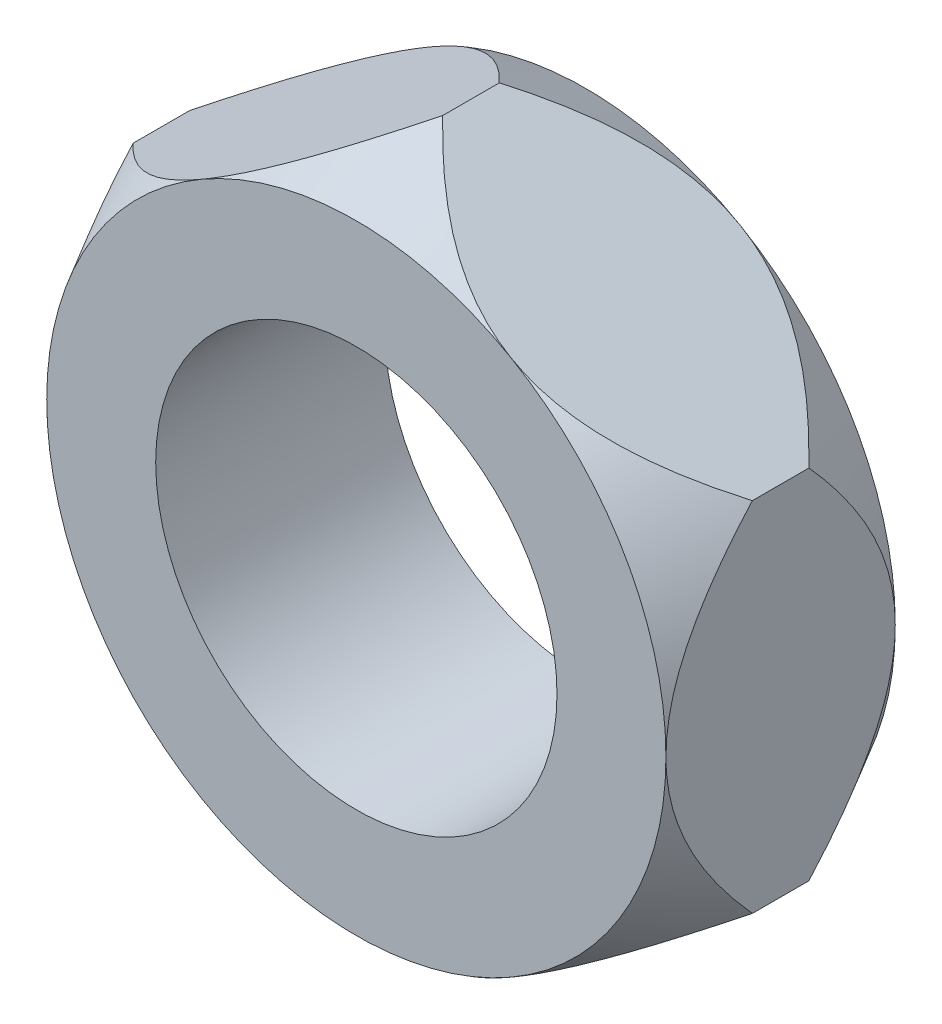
ISO-10303-21;
HEADER;
FILE_DESCRIPTION(('STEP AP214'),'2;1');
FILE_NAME('part.step','',(''),(''),'','','');
FILE_SCHEMA(('AUTOMOTIVE_DESIGN { 1 0 10303 214 1 1 1 1 }'));
ENDSEC;
DATA;
#1=APPLICATION_CONTEXT('core data for automotive mechanical design processes');
#2=APPLICATION_PROTOCOL_DEFINITION('international standard','automotive_design',2000,#1);
#3=PRODUCT_CONTEXT('',#1,'mechanical');
#4=PRODUCT('Part','Part','',(#3));
#5=PRODUCT_RELATED_PRODUCT_CATEGORY('part','',(#4));
#6=PRODUCT_DEFINITION_FORMATION('','',#4);
#7=PRODUCT_DEFINITION_CONTEXT('part definition',#1,'design');
#8=PRODUCT_DEFINITION('design','',#6,#7);
#9=PRODUCT_DEFINITION_SHAPE('','',#8);
#10=(LENGTH_UNIT() NAMED_UNIT(*) SI_UNIT(.MILLI.,.METRE.));
#11=(NAMED_UNIT(*) PLANE_ANGLE_UNIT() SI_UNIT($,.RADIAN.));
#12=(NAMED_UNIT(*) SI_UNIT($,.STERADIAN.) SOLID_ANGLE_UNIT());
#13=UNCERTAINTY_MEASURE_WITH_UNIT(LENGTH_MEASURE(1.E-05),#10,'distance_accuracy_value','');
#14=(GEOMETRIC_REPRESENTATION_CONTEXT(3) GLOBAL_UNCERTAINTY_ASSIGNED_CONTEXT((#13)) GLOBAL_UNIT_ASSIGNED_CONTEXT((#10,
#11,#12)) REPRESENTATION_CONTEXT('',''));
#15=CARTESIAN_POINT('',(0.,0.,0.));
#16=DIRECTION('',(0.,0.,1.));
#17=DIRECTION('',(1.,0.,0.));
#18=AXIS2_PLACEMENT_3D('',#15,#16,#17);
#19=CARTESIAN_POINT('',(2.7,1.55884572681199,2.));
#20=DIRECTION('',(-0.5,-0.866025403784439,0.));
#21=DIRECTION('',(0.866025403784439,-0.5,0.));
#22=AXIS2_PLACEMENT_3D('',#19,#20,#21);
#23=PLANE('',#22);
#24=DIRECTION('',(0.,0.,-1.));
#25=VECTOR('',#24,1.);
#26=CARTESIAN_POINT('',(2.7,1.55884572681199,2.));
#27=LINE('',#26,#25);
#28=CARTESIAN_POINT('',(2.7,1.55884572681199,1.2464646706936));
#29=VERTEX_POINT('',#28);
#30=CARTESIAN_POINT('',(2.7,1.55884572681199,0.753535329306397));
#31=VERTEX_POINT('',#30);
#32=EDGE_CURVE('E147',#29,#31,#27,.T.);
#33=ORIENTED_EDGE('',*,*,#32,.T.);
#34=CARTESIAN_POINT('',(2.7002,1.55873025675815,0.753743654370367));
#35=CARTESIAN_POINT('',(2.64419141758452,1.59106682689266,0.695475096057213));
#36=CARTESIAN_POINT('',(2.58702488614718,1.62407193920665,0.638578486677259));
#37=CARTESIAN_POINT('',(2.46958468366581,1.69187607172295,0.528431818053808));
#38=CARTESIAN_POINT('',(2.40929511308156,1.72668427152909,0.475204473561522));
#39=CARTESIAN_POINT('',(2.28374274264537,1.79917196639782,0.372600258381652));
#40=CARTESIAN_POINT('',(2.21838872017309,1.83690412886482,0.323369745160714));
#41=CARTESIAN_POINT('',(2.08394160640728,1.91452720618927,0.232596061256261));
#42=CARTESIAN_POINT('',(2.01485800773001,1.95441264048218,0.191034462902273));
#43=CARTESIAN_POINT('',(1.86986599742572,2.03812381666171,0.116709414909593));
#44=CARTESIAN_POINT('',(1.79379644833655,2.08204259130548,0.0843526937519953));
#45=CARTESIAN_POINT('',(1.63864870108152,2.17161718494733,0.0344081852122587));
#46=CARTESIAN_POINT('',(1.55960038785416,2.21725574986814,0.0167011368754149));
#47=CARTESIAN_POINT('',(1.39916202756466,2.30988488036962,-0.00179955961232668));
#48=CARTESIAN_POINT('',(1.31775648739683,2.35688439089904,-0.00242274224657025));
#49=CARTESIAN_POINT('',(1.15615297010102,2.45018622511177,0.0138009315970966));
#50=CARTESIAN_POINT('',(1.07595804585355,2.49648678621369,0.0306862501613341));
#51=CARTESIAN_POINT('',(0.89993793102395,2.59811204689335,0.0853197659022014));
#52=CARTESIAN_POINT('',(0.80509571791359,2.65286922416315,0.127165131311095));
#53=CARTESIAN_POINT('',(0.621874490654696,2.75865204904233,0.227329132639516));
#54=CARTESIAN_POINT('',(0.533534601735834,2.80965510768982,0.285738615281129));
#55=CARTESIAN_POINT('',(0.368100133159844,2.90516874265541,0.409739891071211));
#56=CARTESIAN_POINT('',(0.290650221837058,2.94988446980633,0.474714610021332));
#57=CARTESIAN_POINT('',(0.178509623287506,3.014628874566,0.576692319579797));
#58=CARTESIAN_POINT('',(0.142054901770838,3.03567601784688,0.611168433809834));
#59=CARTESIAN_POINT('',(0.0701839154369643,3.07717075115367,0.681486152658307));
#60=CARTESIAN_POINT('',(0.034767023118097,3.09761870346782,0.717326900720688));
#61=CARTESIAN_POINT('',(-0.000200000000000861,3.11780692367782,0.753743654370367));
#62=B_SPLINE_CURVE_WITH_KNOTS('',3,(#34,#35,#36,#37,#38,#39,#40,#41,#42,#43,#44,#45,#46,#47,#48,
#49,#50,#51,#52,#53,#54,#55,#56,#57,#58,#59,#60,#61),.UNSPECIFIED.,.F.,.F.,(4,2,2,2,2,2,2,2,2,2,
2,2,2,4),(0.,0.261243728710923,0.523981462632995,0.793952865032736,1.06326685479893,
1.34309271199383,1.62061748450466,1.90091044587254,2.18182045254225,2.53153788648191,
2.8832117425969,3.2143875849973,3.37759740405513,3.54070641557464),.UNSPECIFIED.);
#63=CARTESIAN_POINT('',(1.35,2.33826859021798,0.));
#64=VERTEX_POINT('',#63);
#65=EDGE_CURVE('E53',#31,#64,#62,.T.);
#66=ORIENTED_EDGE('',*,*,#65,.T.);
#67=CARTESIAN_POINT('',(0.,3.11769145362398,0.753535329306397));
#68=VERTEX_POINT('',#67);
#69=EDGE_CURVE('E121',#64,#68,#62,.T.);
#70=ORIENTED_EDGE('',*,*,#69,.T.);
#71=DIRECTION('',(0.,0.,-1.));
#72=VECTOR('',#71,1.);
#73=CARTESIAN_POINT('',(0.,3.11769145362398,2.));
#74=LINE('',#73,#72);
#75=CARTESIAN_POINT('',(0.,3.11769145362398,1.2464646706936));
#76=VERTEX_POINT('',#75);
#77=EDGE_CURVE('E251',#76,#68,#74,.T.);
#78=ORIENTED_EDGE('',*,*,#77,.F.);
#79=CARTESIAN_POINT('',(2.7002,1.55873025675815,1.24625634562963));
#80=CARTESIAN_POINT('',(2.64419141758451,1.59106682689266,1.30452490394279));
#81=CARTESIAN_POINT('',(2.58702488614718,1.62407193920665,1.36142151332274));
#82=CARTESIAN_POINT('',(2.46958468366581,1.69187607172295,1.47156818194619));
#83=CARTESIAN_POINT('',(2.40929511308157,1.72668427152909,1.52479552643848));
#84=CARTESIAN_POINT('',(2.28374274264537,1.79917196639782,1.62739974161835));
#85=CARTESIAN_POINT('',(2.21838872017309,1.83690412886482,1.67663025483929));
#86=CARTESIAN_POINT('',(2.08394160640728,1.91452720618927,1.76740393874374));
#87=CARTESIAN_POINT('',(2.01485800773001,1.95441264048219,1.80896553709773));
#88=CARTESIAN_POINT('',(1.86986599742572,2.03812381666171,1.88329058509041));
#89=CARTESIAN_POINT('',(1.79379644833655,2.08204259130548,1.91564730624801));
#90=CARTESIAN_POINT('',(1.63864870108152,2.17161718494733,1.96559181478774));
#91=CARTESIAN_POINT('',(1.55960038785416,2.21725574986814,1.98329886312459));
#92=CARTESIAN_POINT('',(1.39916202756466,2.30988488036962,2.00179955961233));
#93=CARTESIAN_POINT('',(1.31775648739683,2.35688439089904,2.00242274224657));
#94=CARTESIAN_POINT('',(1.15615297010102,2.45018622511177,1.9861990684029));
#95=CARTESIAN_POINT('',(1.07595804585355,2.49648678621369,1.96931374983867));
#96=CARTESIAN_POINT('',(0.89993793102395,2.59811204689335,1.9146802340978));
#97=CARTESIAN_POINT('',(0.80509571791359,2.65286922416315,1.8728348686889));
#98=CARTESIAN_POINT('',(0.621874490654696,2.75865204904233,1.77267086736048));
#99=CARTESIAN_POINT('',(0.533534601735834,2.80965510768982,1.71426138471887));
#100=CARTESIAN_POINT('',(0.368100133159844,2.90516874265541,1.59026010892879));
#101=CARTESIAN_POINT('',(0.290650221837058,2.94988446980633,1.52528538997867));
#102=CARTESIAN_POINT('',(0.178509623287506,3.014628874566,1.4233076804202));
#103=CARTESIAN_POINT('',(0.142054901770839,3.03567601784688,1.38883156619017));
#104=CARTESIAN_POINT('',(0.0701839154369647,3.07717075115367,1.31851384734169));
#105=CARTESIAN_POINT('',(0.0347670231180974,3.09761870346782,1.28267309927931));
#106=CARTESIAN_POINT('',(-0.000200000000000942,3.11780692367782,1.24625634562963));
#107=B_SPLINE_CURVE_WITH_KNOTS('',3,(#79,#80,#81,#82,#83,#84,#85,#86,#87,#88,#89,#90,#91,#92,
#93,#94,#95,#96,#97,#98,#99,#100,#101,#102,#103,#104,#105,#106),.UNSPECIFIED.,.F.,.F.,(4,2,2,2,
2,2,2,2,2,2,2,2,2,4),(0.,0.261243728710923,0.523981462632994,0.793952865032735,1.06326685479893,
1.34309271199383,1.62061748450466,1.90091044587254,2.18182045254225,2.53153788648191,
2.8832117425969,3.2143875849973,3.37759740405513,3.54070641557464),.UNSPECIFIED.);
#108=CARTESIAN_POINT('',(1.35,2.33826859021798,2.));
#109=VERTEX_POINT('',#108);
#110=EDGE_CURVE('E232',#109,#76,#107,.T.);
#111=ORIENTED_EDGE('',*,*,#110,.F.);
#112=EDGE_CURVE('E237',#29,#109,#107,.T.);
#113=ORIENTED_EDGE('',*,*,#112,.F.);
#114=EDGE_LOOP('',(#33,#66,#70,#78,#111,#113));
#115=FACE_BOUND('',#114,.T.);
#116=ADVANCED_FACE('F32',(#115),#23,.F.);
#117=CARTESIAN_POINT('',(0.,3.11769145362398,2.));
#118=DIRECTION('',(0.5,-0.866025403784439,0.));
#119=DIRECTION('',(0.866025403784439,0.5,0.));
#120=AXIS2_PLACEMENT_3D('',#117,#118,#119);
#121=PLANE('',#120);
#122=ORIENTED_EDGE('',*,*,#77,.T.);
#123=CARTESIAN_POINT('',(0.000199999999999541,3.11780692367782,0.753743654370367));
#124=CARTESIAN_POINT('',(-0.0558085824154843,3.08547035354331,0.695475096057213));
#125=CARTESIAN_POINT('',(-0.112975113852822,3.05246524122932,0.638578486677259));
#126=CARTESIAN_POINT('',(-0.230415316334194,2.98466110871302,0.528431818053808));
#127=CARTESIAN_POINT('',(-0.290704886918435,2.94985290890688,0.475204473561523));
#128=CARTESIAN_POINT('',(-0.416257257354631,2.87736521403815,0.372600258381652));
#129=CARTESIAN_POINT('',(-0.481611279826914,2.83963305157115,0.323369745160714));
#130=CARTESIAN_POINT('',(-0.616058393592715,2.7620099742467,0.232596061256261));
#131=CARTESIAN_POINT('',(-0.685141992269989,2.72212453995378,0.191034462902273));
#132=CARTESIAN_POINT('',(-0.830134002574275,2.63841336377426,0.116709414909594));
#133=CARTESIAN_POINT('',(-0.906203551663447,2.59449458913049,0.0843526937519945));
#134=CARTESIAN_POINT('',(-1.06135129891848,2.50491999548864,0.0344081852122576));
#135=CARTESIAN_POINT('',(-1.14039961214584,2.45928143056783,0.0167011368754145));
#136=CARTESIAN_POINT('',(-1.30083797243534,2.36665230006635,-0.0017995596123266));
#137=CARTESIAN_POINT('',(-1.38224351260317,2.31965278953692,-0.00242274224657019));
#138=CARTESIAN_POINT('',(-1.54384702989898,2.2263509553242,0.0138009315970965));
#139=CARTESIAN_POINT('',(-1.62404195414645,2.18005039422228,0.0306862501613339));
#140=CARTESIAN_POINT('',(-1.80006206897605,2.07842513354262,0.0853197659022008));
#141=CARTESIAN_POINT('',(-1.89490428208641,2.02366795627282,0.127165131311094));
#142=CARTESIAN_POINT('',(-2.0781255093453,1.91788513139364,0.227329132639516));
#143=CARTESIAN_POINT('',(-2.16646539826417,1.86688207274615,0.285738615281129));
#144=CARTESIAN_POINT('',(-2.33189986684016,1.77136843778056,0.409739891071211));
#145=CARTESIAN_POINT('',(-2.40934977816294,1.72665271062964,0.474714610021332));
#146=CARTESIAN_POINT('',(-2.52149037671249,1.66190830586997,0.576692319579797));
#147=CARTESIAN_POINT('',(-2.55794509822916,1.64086116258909,0.611168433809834));
#148=CARTESIAN_POINT('',(-2.62981608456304,1.5993664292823,0.681486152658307));
#149=CARTESIAN_POINT('',(-2.6652329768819,1.57891847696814,0.717326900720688));
#150=CARTESIAN_POINT('',(-2.7002,1.55873025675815,0.753743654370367));
#151=B_SPLINE_CURVE_WITH_KNOTS('',3,(#123,#124,#125,#126,#127,#128,#129,#130,#131,#132,#133,
#134,#135,#136,#137,#138,#139,#140,#141,#142,#143,#144,#145,#146,#147,#148,#149,#150),
.UNSPECIFIED.,.F.,.F.,(4,2,2,2,2,2,2,2,2,2,2,2,2,4),(0.,0.261243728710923,0.523981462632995,
0.793952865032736,1.06326685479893,1.34309271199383,1.62061748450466,1.90091044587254,
2.18182045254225,2.53153788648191,2.8832117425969,3.2143875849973,3.37759740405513,
3.54070641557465),.UNSPECIFIED.);
#152=CARTESIAN_POINT('',(-1.35,2.33826859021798,0.));
#153=VERTEX_POINT('',#152);
#154=EDGE_CURVE('E126',#68,#153,#151,.T.);
#155=ORIENTED_EDGE('',*,*,#154,.T.);
#156=CARTESIAN_POINT('',(-2.7,1.55884572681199,0.753535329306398));
#157=VERTEX_POINT('',#156);
#158=EDGE_CURVE('E157',#153,#157,#151,.T.);
#159=ORIENTED_EDGE('',*,*,#158,.T.);
#160=DIRECTION('',(0.,0.,-1.));
#161=VECTOR('',#160,1.);
#162=CARTESIAN_POINT('',(-2.7,1.55884572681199,2.));
#163=LINE('',#162,#161);
#164=CARTESIAN_POINT('',(-2.7,1.55884572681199,1.2464646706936));
#165=VERTEX_POINT('',#164);
#166=EDGE_CURVE('E248',#165,#157,#163,.T.);
#167=ORIENTED_EDGE('',*,*,#166,.F.);
#168=CARTESIAN_POINT('',(0.000199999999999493,3.11780692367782,1.24625634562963));
#169=CARTESIAN_POINT('',(-0.0558085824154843,3.08547035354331,1.30452490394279));
#170=CARTESIAN_POINT('',(-0.112975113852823,3.05246524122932,1.36142151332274));
#171=CARTESIAN_POINT('',(-0.230415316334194,2.98466110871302,1.47156818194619));
#172=CARTESIAN_POINT('',(-0.290704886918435,2.94985290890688,1.52479552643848));
#173=CARTESIAN_POINT('',(-0.416257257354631,2.87736521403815,1.62739974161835));
#174=CARTESIAN_POINT('',(-0.481611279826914,2.83963305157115,1.67663025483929));
#175=CARTESIAN_POINT('',(-0.616058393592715,2.7620099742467,1.76740393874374));
#176=CARTESIAN_POINT('',(-0.685141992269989,2.72212453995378,1.80896553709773));
#177=CARTESIAN_POINT('',(-0.830134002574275,2.63841336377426,1.88329058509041));
#178=CARTESIAN_POINT('',(-0.906203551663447,2.59449458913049,1.91564730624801));
#179=CARTESIAN_POINT('',(-1.06135129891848,2.50491999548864,1.96559181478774));
#180=CARTESIAN_POINT('',(-1.14039961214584,2.45928143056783,1.98329886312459));
#181=CARTESIAN_POINT('',(-1.30083797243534,2.36665230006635,2.00179955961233));
#182=CARTESIAN_POINT('',(-1.38224351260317,2.31965278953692,2.00242274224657));
#183=CARTESIAN_POINT('',(-1.54384702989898,2.2263509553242,1.9861990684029));
#184=CARTESIAN_POINT('',(-1.62404195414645,2.18005039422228,1.96931374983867));
#185=CARTESIAN_POINT('',(-1.80006206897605,2.07842513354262,1.9146802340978));
#186=CARTESIAN_POINT('',(-1.89490428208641,2.02366795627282,1.87283486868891));
#187=CARTESIAN_POINT('',(-2.0781255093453,1.91788513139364,1.77267086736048));
#188=CARTESIAN_POINT('',(-2.16646539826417,1.86688207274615,1.71426138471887));
#189=CARTESIAN_POINT('',(-2.33189986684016,1.77136843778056,1.59026010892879));
#190=CARTESIAN_POINT('',(-2.40934977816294,1.72665271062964,1.52528538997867));
#191=CARTESIAN_POINT('',(-2.52149037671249,1.66190830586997,1.4233076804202));
#192=CARTESIAN_POINT('',(-2.55794509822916,1.64086116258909,1.38883156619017));
#193=CARTESIAN_POINT('',(-2.62981608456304,1.5993664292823,1.31851384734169));
#194=CARTESIAN_POINT('',(-2.6652329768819,1.57891847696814,1.28267309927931));
#195=CARTESIAN_POINT('',(-2.7002,1.55873025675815,1.24625634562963));
#196=B_SPLINE_CURVE_WITH_KNOTS('',3,(#168,#169,#170,#171,#172,#173,#174,#175,#176,#177,#178,
#179,#180,#181,#182,#183,#184,#185,#186,#187,#188,#189,#190,#191,#192,#193,#194,#195),
.UNSPECIFIED.,.F.,.F.,(4,2,2,2,2,2,2,2,2,2,2,2,2,4),(0.,0.261243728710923,0.523981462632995,
0.793952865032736,1.06326685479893,1.34309271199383,1.62061748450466,1.90091044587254,
2.18182045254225,2.53153788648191,2.8832117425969,3.2143875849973,3.37759740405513,
3.54070641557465),.UNSPECIFIED.);
#197=CARTESIAN_POINT('',(-1.35,2.33826859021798,2.));
#198=VERTEX_POINT('',#197);
#199=EDGE_CURVE('E226',#198,#165,#196,.T.);
#200=ORIENTED_EDGE('',*,*,#199,.F.);
#201=EDGE_CURVE('E231',#76,#198,#196,.T.);
#202=ORIENTED_EDGE('',*,*,#201,.F.);
#203=EDGE_LOOP('',(#122,#155,#159,#167,#200,#202));
#204=FACE_BOUND('',#203,.T.);
#205=ADVANCED_FACE('F207',(#204),#121,.F.);
#206=CARTESIAN_POINT('',(-2.7,1.55884572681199,2.));
#207=DIRECTION('',(1.,0.,0.));
#208=DIRECTION('',(0.,1.,0.));
#209=AXIS2_PLACEMENT_3D('',#206,#207,#208);
#210=PLANE('',#209);
#211=ORIENTED_EDGE('',*,*,#166,.T.);
#212=CARTESIAN_POINT('',(-2.7,-2.87817931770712,2.24852928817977));
#213=CARTESIAN_POINT('',(-2.7,-2.8186589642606,2.17023395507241));
#214=CARTESIAN_POINT('',(-2.7,-2.75860419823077,2.0923388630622));
#215=CARTESIAN_POINT('',(-2.7,-2.63720662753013,1.93752788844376));
#216=CARTESIAN_POINT('',(-2.7,-2.57586349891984,1.86061226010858));
#217=CARTESIAN_POINT('',(-2.7,-2.45110039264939,1.7072418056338));
#218=CARTESIAN_POINT('',(-2.7,-2.38766607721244,1.63079860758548));
#219=CARTESIAN_POINT('',(-2.7,-2.25902577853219,1.47942646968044));
#220=CARTESIAN_POINT('',(-2.7,-2.1938199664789,1.40449738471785));
#221=CARTESIAN_POINT('',(-2.7,-2.05645651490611,1.25112014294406));
#222=CARTESIAN_POINT('',(-2.7,-1.98413893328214,1.17281456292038));
#223=CARTESIAN_POINT('',(-2.7,-1.83655748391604,1.0190347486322));
#224=CARTESIAN_POINT('',(-2.7,-1.76129405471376,0.943560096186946));
#225=CARTESIAN_POINT('',(-2.7,-1.60744597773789,0.796663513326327));
#226=CARTESIAN_POINT('',(-2.7,-1.52887539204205,0.725226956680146));
#227=CARTESIAN_POINT('',(-2.7,-1.36737041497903,0.587509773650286));
#228=CARTESIAN_POINT('',(-2.7,-1.28443921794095,0.521225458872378));
#229=CARTESIAN_POINT('',(-2.7,-1.14666852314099,0.42037343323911));
#230=CARTESIAN_POINT('',(-2.7,-1.09350675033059,0.383528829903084));
#231=CARTESIAN_POINT('',(-2.7,-0.98499557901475,0.313203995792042));
#232=CARTESIAN_POINT('',(-2.7,-0.929645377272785,0.279725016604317));
#233=CARTESIAN_POINT('',(-2.7,-0.761123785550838,0.186194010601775));
#234=CARTESIAN_POINT('',(-2.7,-0.644345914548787,0.132176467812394));
#235=CARTESIAN_POINT('',(-2.7,-0.438990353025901,0.0617142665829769));
#236=CARTESIAN_POINT('',(-2.7,-0.352652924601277,0.0388372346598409));
#237=CARTESIAN_POINT('',(-2.7,-0.177313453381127,0.00796631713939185));
#238=CARTESIAN_POINT('',(-2.7,-0.0883138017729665,-4.0539679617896E-05));
#239=CARTESIAN_POINT('',(-2.7,0.0898668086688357,4.09368854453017E-05));
#240=CARTESIAN_POINT('',(-2.7,0.179047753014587,0.00816333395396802));
#241=CARTESIAN_POINT('',(-2.7,0.354722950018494,0.0393129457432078));
#242=CARTESIAN_POINT('',(-2.7,0.441214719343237,0.0623535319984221));
#243=CARTESIAN_POINT('',(-2.7,0.648765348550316,0.133878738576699));
#244=CARTESIAN_POINT('',(-2.7,0.767436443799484,0.18919099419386));
#245=CARTESIAN_POINT('',(-2.7,0.93857097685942,0.284963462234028));
#246=CARTESIAN_POINT('',(-2.7,0.994762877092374,0.319248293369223));
#247=CARTESIAN_POINT('',(-2.7,1.10489430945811,0.391254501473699));
#248=CARTESIAN_POINT('',(-2.7,1.15883465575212,0.428974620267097));
#249=CARTESIAN_POINT('',(-2.7,1.29456380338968,0.529225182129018));
#250=CARTESIAN_POINT('',(-2.7,1.37487791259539,0.593737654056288));
#251=CARTESIAN_POINT('',(-2.7,1.53141731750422,0.727579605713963));
#252=CARTESIAN_POINT('',(-2.7,1.60763994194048,0.796912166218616));
#253=CARTESIAN_POINT('',(-2.7,1.75696307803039,0.939362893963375));
#254=CARTESIAN_POINT('',(-2.7,1.83005137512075,1.01249377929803));
#255=CARTESIAN_POINT('',(-2.7,1.97343386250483,1.16144862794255));
#256=CARTESIAN_POINT('',(-2.7,2.04372766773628,1.23727295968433));
#257=CARTESIAN_POINT('',(-2.7,2.17745100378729,1.38594673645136));
#258=CARTESIAN_POINT('',(-2.7,2.24102802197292,1.45866412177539));
#259=CARTESIAN_POINT('',(-2.7,2.36647734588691,1.60556225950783));
#260=CARTESIAN_POINT('',(-2.7,2.42834950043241,1.67974314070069));
#261=CARTESIAN_POINT('',(-2.7,2.55009776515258,1.82862770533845));
#262=CARTESIAN_POINT('',(-2.7,2.609986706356,1.90332092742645));
#263=CARTESIAN_POINT('',(-2.7,2.7285155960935,2.05366355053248));
#264=CARTESIAN_POINT('',(-2.7,2.78715584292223,2.12931271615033));
#265=CARTESIAN_POINT('',(-2.7,2.84527586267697,2.20535374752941));
#266=B_SPLINE_CURVE_WITH_KNOTS('',3,(#212,#213,#214,#215,#216,#217,#218,#219,#220,#221,#222,
#223,#224,#225,#226,#227,#228,#229,#230,#231,#232,#233,#234,#235,#236,#237,#238,#239,#240,#241,
#242,#243,#244,#245,#246,#247,#248,#249,#250,#251,#252,#253,#254,#255,#256,#257,#258,#259,#260,
#261,#262,#263,#264,#265),.UNSPECIFIED.,.F.,.F.,(4,2,2,2,2,2,2,2,2,2,2,2,2,2,2,2,2,2,2,2,2,2,2,
2,2,2,4),(0.,0.295056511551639,0.590188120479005,0.888170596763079,1.1861243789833,
1.50583568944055,1.82549958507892,2.1439196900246,2.46210970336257,2.65603493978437,
2.8500320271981,3.23376233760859,3.50065084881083,3.76730644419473,4.03452579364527,
4.30198499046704,4.69239792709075,4.88980852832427,5.08714711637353,5.39592214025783,
5.7048963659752,6.01498181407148,6.32510984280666,6.61485293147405,6.90462163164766,
7.19182200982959,7.47895299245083),.UNSPECIFIED.);
#267=CARTESIAN_POINT('',(-2.7,0.,0.));
#268=VERTEX_POINT('',#267);
#269=EDGE_CURVE('E201',#157,#268,#266,.F.);
#270=ORIENTED_EDGE('',*,*,#269,.T.);
#271=CARTESIAN_POINT('',(-2.7,-1.55884572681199,0.753535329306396));
#272=VERTEX_POINT('',#271);
#273=EDGE_CURVE('E195',#268,#272,#266,.F.);
#274=ORIENTED_EDGE('',*,*,#273,.T.);
#275=DIRECTION('',(0.,0.,-1.));
#276=VECTOR('',#275,1.);
#277=CARTESIAN_POINT('',(-2.7,-1.55884572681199,2.));
#278=LINE('',#277,#276);
#279=CARTESIAN_POINT('',(-2.7,-1.55884572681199,1.2464646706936));
#280=VERTEX_POINT('',#279);
#281=EDGE_CURVE('E245',#280,#272,#278,.T.);
#282=ORIENTED_EDGE('',*,*,#281,.F.);
#283=CARTESIAN_POINT('',(-2.7,-2.87817931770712,-0.248529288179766));
#284=CARTESIAN_POINT('',(-2.7,-2.8186589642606,-0.170233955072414));
#285=CARTESIAN_POINT('',(-2.7,-2.75860419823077,-0.0923388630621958));
#286=CARTESIAN_POINT('',(-2.7,-2.63720662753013,0.062472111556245));
#287=CARTESIAN_POINT('',(-2.7,-2.57586349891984,0.139387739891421));
#288=CARTESIAN_POINT('',(-2.7,-2.45110039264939,0.292758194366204));
#289=CARTESIAN_POINT('',(-2.7,-2.38766607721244,0.369201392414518));
#290=CARTESIAN_POINT('',(-2.7,-2.25902577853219,0.520573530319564));
#291=CARTESIAN_POINT('',(-2.7,-2.1938199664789,0.595502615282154));
#292=CARTESIAN_POINT('',(-2.7,-2.05645651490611,0.748879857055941));
#293=CARTESIAN_POINT('',(-2.7,-1.98413893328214,0.827185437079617));
#294=CARTESIAN_POINT('',(-2.7,-1.83655748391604,0.980965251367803));
#295=CARTESIAN_POINT('',(-2.7,-1.76129405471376,1.05643990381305));
#296=CARTESIAN_POINT('',(-2.7,-1.60744597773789,1.20333648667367));
#297=CARTESIAN_POINT('',(-2.7,-1.52887539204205,1.27477304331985));
#298=CARTESIAN_POINT('',(-2.7,-1.36737041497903,1.41249022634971));
#299=CARTESIAN_POINT('',(-2.7,-1.28443921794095,1.47877454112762));
#300=CARTESIAN_POINT('',(-2.7,-1.14666852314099,1.57962656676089));
#301=CARTESIAN_POINT('',(-2.7,-1.09350675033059,1.61647117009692));
#302=CARTESIAN_POINT('',(-2.7,-0.98499557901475,1.68679600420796));
#303=CARTESIAN_POINT('',(-2.7,-0.929645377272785,1.72027498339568));
#304=CARTESIAN_POINT('',(-2.7,-0.761123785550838,1.81380598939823));
#305=CARTESIAN_POINT('',(-2.7,-0.644345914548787,1.86782353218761));
#306=CARTESIAN_POINT('',(-2.7,-0.438990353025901,1.93828573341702));
#307=CARTESIAN_POINT('',(-2.7,-0.352652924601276,1.96116276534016));
#308=CARTESIAN_POINT('',(-2.7,-0.177313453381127,1.99203368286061));
#309=CARTESIAN_POINT('',(-2.7,-0.0883138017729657,2.00004053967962));
#310=CARTESIAN_POINT('',(-2.7,0.0898668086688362,1.99995906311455));
#311=CARTESIAN_POINT('',(-2.7,0.179047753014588,1.99183666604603));
#312=CARTESIAN_POINT('',(-2.7,0.354722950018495,1.96068705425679));
#313=CARTESIAN_POINT('',(-2.7,0.441214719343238,1.93764646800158));
#314=CARTESIAN_POINT('',(-2.7,0.648765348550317,1.8661212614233));
#315=CARTESIAN_POINT('',(-2.7,0.767436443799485,1.81080900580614));
#316=CARTESIAN_POINT('',(-2.7,0.938570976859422,1.71503653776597));
#317=CARTESIAN_POINT('',(-2.7,0.994762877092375,1.68075170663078));
#318=CARTESIAN_POINT('',(-2.7,1.10489430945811,1.6087454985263));
#319=CARTESIAN_POINT('',(-2.7,1.15883465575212,1.5710253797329));
#320=CARTESIAN_POINT('',(-2.7,1.29456380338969,1.47077481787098));
#321=CARTESIAN_POINT('',(-2.7,1.37487791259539,1.40626234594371));
#322=CARTESIAN_POINT('',(-2.7,1.53141731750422,1.27242039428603));
#323=CARTESIAN_POINT('',(-2.7,1.60763994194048,1.20308783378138));
#324=CARTESIAN_POINT('',(-2.7,1.75696307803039,1.06063710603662));
#325=CARTESIAN_POINT('',(-2.7,1.83005137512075,0.987506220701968));
#326=CARTESIAN_POINT('',(-2.7,1.97343386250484,0.838551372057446));
#327=CARTESIAN_POINT('',(-2.7,2.04372766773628,0.762727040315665));
#328=CARTESIAN_POINT('',(-2.7,2.17745100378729,0.614053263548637));
#329=CARTESIAN_POINT('',(-2.7,2.24102802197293,0.5413358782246));
#330=CARTESIAN_POINT('',(-2.7,2.36647734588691,0.394437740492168));
#331=CARTESIAN_POINT('',(-2.7,2.42834950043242,0.320256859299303));
#332=CARTESIAN_POINT('',(-2.7,2.55009776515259,0.171372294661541));
#333=CARTESIAN_POINT('',(-2.7,2.609986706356,0.0966790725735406));
#334=CARTESIAN_POINT('',(-2.7,2.7285155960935,-0.0536635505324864));
#335=CARTESIAN_POINT('',(-2.7,2.78715584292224,-0.129312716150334));
#336=CARTESIAN_POINT('',(-2.7,2.84527586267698,-0.20535374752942));
#337=B_SPLINE_CURVE_WITH_KNOTS('',3,(#283,#284,#285,#286,#287,#288,#289,#290,#291,#292,#293,
#294,#295,#296,#297,#298,#299,#300,#301,#302,#303,#304,#305,#306,#307,#308,#309,#310,#311,#312,
#313,#314,#315,#316,#317,#318,#319,#320,#321,#322,#323,#324,#325,#326,#327,#328,#329,#330,#331,
#332,#333,#334,#335,#336),.UNSPECIFIED.,.F.,.F.,(4,2,2,2,2,2,2,2,2,2,2,2,2,2,2,2,2,2,2,2,2,2,2,
2,2,2,4),(0.,0.295056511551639,0.590188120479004,0.888170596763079,1.1861243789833,
1.50583568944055,1.82549958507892,2.1439196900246,2.46210970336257,2.65603493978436,
2.8500320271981,3.23376233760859,3.50065084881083,3.76730644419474,4.03452579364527,
4.30198499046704,4.69239792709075,4.88980852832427,5.08714711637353,5.39592214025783,
5.7048963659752,6.01498181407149,6.32510984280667,6.61485293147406,6.90462163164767,
7.1918220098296,7.47895299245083),.UNSPECIFIED.);
#338=CARTESIAN_POINT('',(-2.7,0.,2.));
#339=VERTEX_POINT('',#338);
#340=EDGE_CURVE('E213',#339,#280,#337,.F.);
#341=ORIENTED_EDGE('',*,*,#340,.F.);
#342=EDGE_CURVE('E219',#165,#339,#337,.F.);
#343=ORIENTED_EDGE('',*,*,#342,.F.);
#344=EDGE_LOOP('',(#211,#270,#274,#282,#341,#343));
#345=FACE_BOUND('',#344,.T.);
#346=ADVANCED_FACE('F203',(#345),#210,.F.);
#347=CARTESIAN_POINT('',(-2.7,-1.55884572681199,2.));
#348=DIRECTION('',(0.5,0.866025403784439,0.));
#349=DIRECTION('',(-0.866025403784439,0.5,0.));
#350=AXIS2_PLACEMENT_3D('',#347,#348,#349);
#351=PLANE('',#350);
#352=ORIENTED_EDGE('',*,*,#281,.T.);
#353=CARTESIAN_POINT('',(-2.7002,-1.55873025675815,0.753743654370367));
#354=CARTESIAN_POINT('',(-2.64419141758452,-1.59106682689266,0.695475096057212));
#355=CARTESIAN_POINT('',(-2.58702488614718,-1.62407193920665,0.638578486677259));
#356=CARTESIAN_POINT('',(-2.46958468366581,-1.69187607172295,0.528431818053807));
#357=CARTESIAN_POINT('',(-2.40929511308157,-1.72668427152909,0.475204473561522));
#358=CARTESIAN_POINT('',(-2.28374274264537,-1.79917196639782,0.372600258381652));
#359=CARTESIAN_POINT('',(-2.21838872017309,-1.83690412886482,0.323369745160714));
#360=CARTESIAN_POINT('',(-2.08394160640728,-1.91452720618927,0.23259606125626));
#361=CARTESIAN_POINT('',(-2.01485800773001,-1.95441264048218,0.191034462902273));
#362=CARTESIAN_POINT('',(-1.86986599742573,-2.03812381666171,0.116709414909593));
#363=CARTESIAN_POINT('',(-1.79379644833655,-2.08204259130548,0.0843526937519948));
#364=CARTESIAN_POINT('',(-1.63864870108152,-2.17161718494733,0.0344081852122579));
#365=CARTESIAN_POINT('',(-1.55960038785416,-2.21725574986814,0.0167011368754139));
#366=CARTESIAN_POINT('',(-1.39916202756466,-2.30988488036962,-0.00179955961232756));
#367=CARTESIAN_POINT('',(-1.31775648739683,-2.35688439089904,-0.00242274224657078));
#368=CARTESIAN_POINT('',(-1.15615297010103,-2.45018622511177,0.0138009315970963));
#369=CARTESIAN_POINT('',(-1.07595804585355,-2.49648678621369,0.0306862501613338));
#370=CARTESIAN_POINT('',(-0.899937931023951,-2.59811204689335,0.0853197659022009));
#371=CARTESIAN_POINT('',(-0.805095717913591,-2.65286922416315,0.127165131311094));
#372=CARTESIAN_POINT('',(-0.621874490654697,-2.75865204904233,0.227329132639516));
#373=CARTESIAN_POINT('',(-0.533534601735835,-2.80965510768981,0.285738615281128));
#374=CARTESIAN_POINT('',(-0.368100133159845,-2.9051687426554,0.40973989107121));
#375=CARTESIAN_POINT('',(-0.290650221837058,-2.94988446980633,0.474714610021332));
#376=CARTESIAN_POINT('',(-0.178509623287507,-3.014628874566,0.576692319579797));
#377=CARTESIAN_POINT('',(-0.142054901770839,-3.03567601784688,0.611168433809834));
#378=CARTESIAN_POINT('',(-0.0701839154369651,-3.07717075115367,0.681486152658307));
#379=CARTESIAN_POINT('',(-0.0347670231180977,-3.09761870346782,0.717326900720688));
#380=CARTESIAN_POINT('',(0.000200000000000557,-3.11780692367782,0.753743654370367));
#381=B_SPLINE_CURVE_WITH_KNOTS('',3,(#353,#354,#355,#356,#357,#358,#359,#360,#361,#362,#363,
#364,#365,#366,#367,#368,#369,#370,#371,#372,#373,#374,#375,#376,#377,#378,#379,#380),
.UNSPECIFIED.,.F.,.F.,(4,2,2,2,2,2,2,2,2,2,2,2,2,4),(0.,0.261243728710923,0.523981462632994,
0.793952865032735,1.06326685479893,1.34309271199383,1.62061748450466,1.90091044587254,
2.18182045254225,2.53153788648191,2.8832117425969,3.2143875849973,3.37759740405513,
3.54070641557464),.UNSPECIFIED.);
#382=CARTESIAN_POINT('',(-1.35,-2.33826859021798,0.));
#383=VERTEX_POINT('',#382);
#384=EDGE_CURVE('E202',#272,#383,#381,.T.);
#385=ORIENTED_EDGE('',*,*,#384,.T.);
#386=CARTESIAN_POINT('',(0.,-3.11769145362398,0.753535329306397));
#387=VERTEX_POINT('',#386);
#388=EDGE_CURVE('E190',#383,#387,#381,.T.);
#389=ORIENTED_EDGE('',*,*,#388,.T.);
#390=DIRECTION('',(0.,0.,-1.));
#391=VECTOR('',#390,1.);
#392=CARTESIAN_POINT('',(0.,-3.11769145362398,2.));
#393=LINE('',#392,#391);
#394=CARTESIAN_POINT('',(0.,-3.11769145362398,1.2464646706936));
#395=VERTEX_POINT('',#394);
#396=EDGE_CURVE('E242',#395,#387,#393,.T.);
#397=ORIENTED_EDGE('',*,*,#396,.F.);
#398=CARTESIAN_POINT('',(-2.7002,-1.55873025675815,1.24625634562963));
#399=CARTESIAN_POINT('',(-2.64419141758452,-1.59106682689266,1.30452490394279));
#400=CARTESIAN_POINT('',(-2.58702488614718,-1.62407193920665,1.36142151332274));
#401=CARTESIAN_POINT('',(-2.46958468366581,-1.69187607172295,1.47156818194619));
#402=CARTESIAN_POINT('',(-2.40929511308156,-1.72668427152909,1.52479552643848));
#403=CARTESIAN_POINT('',(-2.28374274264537,-1.79917196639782,1.62739974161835));
#404=CARTESIAN_POINT('',(-2.21838872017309,-1.83690412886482,1.67663025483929));
#405=CARTESIAN_POINT('',(-2.08394160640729,-1.91452720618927,1.76740393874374));
#406=CARTESIAN_POINT('',(-2.01485800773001,-1.95441264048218,1.80896553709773));
#407=CARTESIAN_POINT('',(-1.86986599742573,-2.03812381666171,1.88329058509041));
#408=CARTESIAN_POINT('',(-1.79379644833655,-2.08204259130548,1.91564730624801));
#409=CARTESIAN_POINT('',(-1.63864870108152,-2.17161718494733,1.96559181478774));
#410=CARTESIAN_POINT('',(-1.55960038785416,-2.21725574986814,1.98329886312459));
#411=CARTESIAN_POINT('',(-1.39916202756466,-2.30988488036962,2.00179955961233));
#412=CARTESIAN_POINT('',(-1.31775648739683,-2.35688439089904,2.00242274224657));
#413=CARTESIAN_POINT('',(-1.15615297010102,-2.45018622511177,1.9861990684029));
#414=CARTESIAN_POINT('',(-1.07595804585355,-2.49648678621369,1.96931374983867));
#415=CARTESIAN_POINT('',(-0.899937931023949,-2.59811204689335,1.9146802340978));
#416=CARTESIAN_POINT('',(-0.805095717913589,-2.65286922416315,1.87283486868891));
#417=CARTESIAN_POINT('',(-0.621874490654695,-2.75865204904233,1.77267086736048));
#418=CARTESIAN_POINT('',(-0.533534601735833,-2.80965510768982,1.71426138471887));
#419=CARTESIAN_POINT('',(-0.368100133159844,-2.90516874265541,1.59026010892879));
#420=CARTESIAN_POINT('',(-0.290650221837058,-2.94988446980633,1.52528538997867));
#421=CARTESIAN_POINT('',(-0.178509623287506,-3.014628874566,1.4233076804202));
#422=CARTESIAN_POINT('',(-0.142054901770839,-3.03567601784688,1.38883156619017));
#423=CARTESIAN_POINT('',(-0.0701839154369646,-3.07717075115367,1.31851384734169));
#424=CARTESIAN_POINT('',(-0.0347670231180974,-3.09761870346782,1.28267309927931));
#425=CARTESIAN_POINT('',(0.000200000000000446,-3.11780692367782,1.24625634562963));
#426=B_SPLINE_CURVE_WITH_KNOTS('',3,(#398,#399,#400,#401,#402,#403,#404,#405,#406,#407,#408,
#409,#410,#411,#412,#413,#414,#415,#416,#417,#418,#419,#420,#421,#422,#423,#424,#425),
.UNSPECIFIED.,.F.,.F.,(4,2,2,2,2,2,2,2,2,2,2,2,2,4),(0.,0.261243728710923,0.523981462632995,
0.793952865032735,1.06326685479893,1.34309271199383,1.62061748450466,1.90091044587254,
2.18182045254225,2.53153788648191,2.8832117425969,3.2143875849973,3.37759740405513,
3.54070641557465),.UNSPECIFIED.);
#427=CARTESIAN_POINT('',(-1.35,-2.33826859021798,2.));
#428=VERTEX_POINT('',#427);
#429=EDGE_CURVE('E221',#428,#395,#426,.T.);
#430=ORIENTED_EDGE('',*,*,#429,.F.);
#431=EDGE_CURVE('E220',#280,#428,#426,.T.);
#432=ORIENTED_EDGE('',*,*,#431,.F.);
#433=EDGE_LOOP('',(#352,#385,#389,#397,#430,#432));
#434=FACE_BOUND('',#433,.T.);
#435=ADVANCED_FACE('F206',(#434),#351,.F.);
#436=CARTESIAN_POINT('',(0.,-3.11769145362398,2.));
#437=DIRECTION('',(-0.5,0.866025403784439,0.));
#438=DIRECTION('',(-0.866025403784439,-0.5,0.));
#439=AXIS2_PLACEMENT_3D('',#436,#437,#438);
#440=PLANE('',#439);
#441=ORIENTED_EDGE('',*,*,#396,.T.);
#442=CARTESIAN_POINT('',(-0.000199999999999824,-3.11780692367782,0.753743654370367));
#443=CARTESIAN_POINT('',(0.0558085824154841,-3.08547035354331,0.695475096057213));
#444=CARTESIAN_POINT('',(0.112975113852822,-3.05246524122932,0.63857848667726));
#445=CARTESIAN_POINT('',(0.230415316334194,-2.98466110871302,0.528431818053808));
#446=CARTESIAN_POINT('',(0.290704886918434,-2.94985290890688,0.475204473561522));
#447=CARTESIAN_POINT('',(0.41625725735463,-2.87736521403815,0.372600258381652));
#448=CARTESIAN_POINT('',(0.481611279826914,-2.83963305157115,0.323369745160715));
#449=CARTESIAN_POINT('',(0.616058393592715,-2.7620099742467,0.232596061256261));
#450=CARTESIAN_POINT('',(0.685141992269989,-2.72212453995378,0.191034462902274));
#451=CARTESIAN_POINT('',(0.830134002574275,-2.63841336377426,0.116709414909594));
#452=CARTESIAN_POINT('',(0.906203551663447,-2.59449458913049,0.0843526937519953));
#453=CARTESIAN_POINT('',(1.06135129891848,-2.50491999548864,0.0344081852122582));
#454=CARTESIAN_POINT('',(1.14039961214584,-2.45928143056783,0.0167011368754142));
#455=CARTESIAN_POINT('',(1.30083797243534,-2.36665230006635,-0.00179955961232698));
#456=CARTESIAN_POINT('',(1.38224351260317,-2.31965278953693,-0.0024227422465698));
#457=CARTESIAN_POINT('',(1.54384702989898,-2.2263509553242,0.0138009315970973));
#458=CARTESIAN_POINT('',(1.62404195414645,-2.18005039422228,0.0306862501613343));
#459=CARTESIAN_POINT('',(1.80006206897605,-2.07842513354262,0.085319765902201));
#460=CARTESIAN_POINT('',(1.89490428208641,-2.02366795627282,0.127165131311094));
#461=CARTESIAN_POINT('',(2.0781255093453,-1.91788513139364,0.227329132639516));
#462=CARTESIAN_POINT('',(2.16646539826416,-1.86688207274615,0.285738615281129));
#463=CARTESIAN_POINT('',(2.33189986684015,-1.77136843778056,0.409739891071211));
#464=CARTESIAN_POINT('',(2.40934977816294,-1.72665271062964,0.474714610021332));
#465=CARTESIAN_POINT('',(2.52149037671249,-1.66190830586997,0.576692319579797));
#466=CARTESIAN_POINT('',(2.55794509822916,-1.64086116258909,0.611168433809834));
#467=CARTESIAN_POINT('',(2.62981608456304,-1.5993664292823,0.681486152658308));
#468=CARTESIAN_POINT('',(2.6652329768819,-1.57891847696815,0.717326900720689));
#469=CARTESIAN_POINT('',(2.7002,-1.55873025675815,0.753743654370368));
#470=B_SPLINE_CURVE_WITH_KNOTS('',3,(#442,#443,#444,#445,#446,#447,#448,#449,#450,#451,#452,
#453,#454,#455,#456,#457,#458,#459,#460,#461,#462,#463,#464,#465,#466,#467,#468,#469),
.UNSPECIFIED.,.F.,.F.,(4,2,2,2,2,2,2,2,2,2,2,2,2,4),(0.,0.261243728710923,0.523981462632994,
0.793952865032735,1.06326685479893,1.34309271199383,1.62061748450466,1.90091044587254,
2.18182045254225,2.53153788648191,2.8832117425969,3.2143875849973,3.37759740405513,
3.54070641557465),.UNSPECIFIED.);
#471=CARTESIAN_POINT('',(1.35,-2.33826859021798,0.));
#472=VERTEX_POINT('',#471);
#473=EDGE_CURVE('E329',#387,#472,#470,.T.);
#474=ORIENTED_EDGE('',*,*,#473,.T.);
#475=CARTESIAN_POINT('',(2.7,-1.55884572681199,0.753535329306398));
#476=VERTEX_POINT('',#475);
#477=EDGE_CURVE('E184',#472,#476,#470,.T.);
#478=ORIENTED_EDGE('',*,*,#477,.T.);
#479=DIRECTION('',(0.,0.,-1.));
#480=VECTOR('',#479,1.);
#481=CARTESIAN_POINT('',(2.7,-1.55884572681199,2.));
#482=LINE('',#481,#480);
#483=CARTESIAN_POINT('',(2.7,-1.55884572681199,1.2464646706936));
#484=VERTEX_POINT('',#483);
#485=EDGE_CURVE('E239',#484,#476,#482,.T.);
#486=ORIENTED_EDGE('',*,*,#485,.F.);
#487=CARTESIAN_POINT('',(-0.000199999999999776,-3.11780692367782,1.24625634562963));
#488=CARTESIAN_POINT('',(0.0558085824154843,-3.08547035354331,1.30452490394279));
#489=CARTESIAN_POINT('',(0.112975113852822,-3.05246524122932,1.36142151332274));
#490=CARTESIAN_POINT('',(0.230415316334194,-2.98466110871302,1.47156818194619));
#491=CARTESIAN_POINT('',(0.290704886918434,-2.94985290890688,1.52479552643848));
#492=CARTESIAN_POINT('',(0.416257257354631,-2.87736521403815,1.62739974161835));
#493=CARTESIAN_POINT('',(0.481611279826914,-2.83963305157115,1.67663025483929));
#494=CARTESIAN_POINT('',(0.616058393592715,-2.7620099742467,1.76740393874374));
#495=CARTESIAN_POINT('',(0.685141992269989,-2.72212453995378,1.80896553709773));
#496=CARTESIAN_POINT('',(0.830134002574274,-2.63841336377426,1.88329058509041));
#497=CARTESIAN_POINT('',(0.906203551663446,-2.59449458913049,1.915647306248));
#498=CARTESIAN_POINT('',(1.06135129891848,-2.50491999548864,1.96559181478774));
#499=CARTESIAN_POINT('',(1.14039961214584,-2.45928143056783,1.98329886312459));
#500=CARTESIAN_POINT('',(1.30083797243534,-2.36665230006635,2.00179955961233));
#501=CARTESIAN_POINT('',(1.38224351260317,-2.31965278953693,2.00242274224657));
#502=CARTESIAN_POINT('',(1.54384702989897,-2.2263509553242,1.9861990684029));
#503=CARTESIAN_POINT('',(1.62404195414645,-2.18005039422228,1.96931374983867));
#504=CARTESIAN_POINT('',(1.80006206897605,-2.07842513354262,1.9146802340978));
#505=CARTESIAN_POINT('',(1.89490428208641,-2.02366795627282,1.87283486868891));
#506=CARTESIAN_POINT('',(2.0781255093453,-1.91788513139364,1.77267086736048));
#507=CARTESIAN_POINT('',(2.16646539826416,-1.86688207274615,1.71426138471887));
#508=CARTESIAN_POINT('',(2.33189986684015,-1.77136843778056,1.59026010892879));
#509=CARTESIAN_POINT('',(2.40934977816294,-1.72665271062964,1.52528538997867));
#510=CARTESIAN_POINT('',(2.52149037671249,-1.66190830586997,1.4233076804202));
#511=CARTESIAN_POINT('',(2.55794509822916,-1.64086116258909,1.38883156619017));
#512=CARTESIAN_POINT('',(2.62981608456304,-1.5993664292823,1.31851384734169));
#513=CARTESIAN_POINT('',(2.6652329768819,-1.57891847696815,1.28267309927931));
#514=CARTESIAN_POINT('',(2.7002,-1.55873025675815,1.24625634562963));
#515=B_SPLINE_CURVE_WITH_KNOTS('',3,(#487,#488,#489,#490,#491,#492,#493,#494,#495,#496,#497,
#498,#499,#500,#501,#502,#503,#504,#505,#506,#507,#508,#509,#510,#511,#512,#513,#514),
.UNSPECIFIED.,.F.,.F.,(4,2,2,2,2,2,2,2,2,2,2,2,2,4),(0.,0.261243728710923,0.523981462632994,
0.793952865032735,1.06326685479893,1.34309271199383,1.62061748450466,1.90091044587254,
2.18182045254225,2.53153788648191,2.8832117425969,3.2143875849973,3.37759740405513,
3.54070641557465),.UNSPECIFIED.);
#516=CARTESIAN_POINT('',(1.35,-2.33826859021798,2.));
#517=VERTEX_POINT('',#516);
#518=EDGE_CURVE('E280',#517,#484,#515,.T.);
#519=ORIENTED_EDGE('',*,*,#518,.F.);
#520=EDGE_CURVE('E279',#395,#517,#515,.T.);
#521=ORIENTED_EDGE('',*,*,#520,.F.);
#522=EDGE_LOOP('',(#441,#474,#478,#486,#519,#521));
#523=FACE_BOUND('',#522,.T.);
#524=ADVANCED_FACE('F288',(#523),#440,.F.);
#525=CARTESIAN_POINT('',(2.7,-1.55884572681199,2.));
#526=DIRECTION('',(-1.,0.,0.));
#527=DIRECTION('',(0.,-1.,0.));
#528=AXIS2_PLACEMENT_3D('',#525,#526,#527);
#529=PLANE('',#528);
#530=ORIENTED_EDGE('',*,*,#485,.T.);
#531=CARTESIAN_POINT('',(2.7,-2.87817931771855,2.2485292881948));
#532=CARTESIAN_POINT('',(2.7,-2.81865896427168,2.17023395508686));
#533=CARTESIAN_POINT('',(2.7,-2.75860419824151,2.09233886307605));
#534=CARTESIAN_POINT('',(2.7,-2.63720662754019,1.93752788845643));
#535=CARTESIAN_POINT('',(2.7,-2.57586349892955,1.86061226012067));
#536=CARTESIAN_POINT('',(2.7,-2.45110039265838,1.7072418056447));
#537=CARTESIAN_POINT('',(2.7,-2.38766607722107,1.63079860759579));
#538=CARTESIAN_POINT('',(2.7,-2.25902577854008,1.47942646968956));
#539=CARTESIAN_POINT('',(2.7,-2.19381996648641,1.40449738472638));
#540=CARTESIAN_POINT('',(2.7,-2.05645651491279,1.25112014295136));
#541=CARTESIAN_POINT('',(2.7,-1.98413893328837,1.17281456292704));
#542=CARTESIAN_POINT('',(2.7,-1.83655748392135,1.01903474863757));
#543=CARTESIAN_POINT('',(2.7,-1.76129405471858,0.943560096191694));
#544=CARTESIAN_POINT('',(2.7,-1.60744597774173,0.796663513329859));
#545=CARTESIAN_POINT('',(2.7,-1.52887539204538,0.72522695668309));
#546=CARTESIAN_POINT('',(2.7,-1.36737041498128,0.587509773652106));
#547=CARTESIAN_POINT('',(2.7,-1.28443921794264,0.521225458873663));
#548=CARTESIAN_POINT('',(2.7,-1.14666852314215,0.420373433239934));
#549=CARTESIAN_POINT('',(2.7,-1.09350675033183,0.383528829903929));
#550=CARTESIAN_POINT('',(2.7,-0.984995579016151,0.313203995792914));
#551=CARTESIAN_POINT('',(2.7,-0.92964537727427,0.279725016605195));
#552=CARTESIAN_POINT('',(2.7,-0.761123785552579,0.186194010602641));
#553=CARTESIAN_POINT('',(2.7,-0.64434591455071,0.132176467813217));
#554=CARTESIAN_POINT('',(2.7,-0.438990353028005,0.0617142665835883));
#555=CARTESIAN_POINT('',(2.7,-0.352652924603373,0.0388372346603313));
#556=CARTESIAN_POINT('',(2.7,-0.177313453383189,0.00796631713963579));
#557=CARTESIAN_POINT('',(2.7,-0.0883138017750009,-4.05396794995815E-05));
#558=CARTESIAN_POINT('',(2.7,0.0898668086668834,4.09368853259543E-05));
#559=CARTESIAN_POINT('',(2.7,0.179047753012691,0.00816333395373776));
#560=CARTESIAN_POINT('',(2.7,0.354722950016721,0.0393129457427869));
#561=CARTESIAN_POINT('',(2.7,0.441214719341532,0.0623535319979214));
#562=CARTESIAN_POINT('',(2.7,0.648765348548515,0.13387873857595));
#563=CARTESIAN_POINT('',(2.7,0.767436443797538,0.189190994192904));
#564=CARTESIAN_POINT('',(2.7,0.938570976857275,0.284963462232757));
#565=CARTESIAN_POINT('',(2.7,0.994762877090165,0.319248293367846));
#566=CARTESIAN_POINT('',(2.7,1.10489430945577,0.391254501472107));
#567=CARTESIAN_POINT('',(2.7,1.15883465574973,0.428974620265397));
#568=CARTESIAN_POINT('',(2.7,1.294563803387,0.529225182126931));
#569=CARTESIAN_POINT('',(2.7,1.37487791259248,0.59373765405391));
#570=CARTESIAN_POINT('',(2.7,1.53141731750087,0.72757960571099));
#571=CARTESIAN_POINT('',(2.7,1.60763994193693,0.796912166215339));
#572=CARTESIAN_POINT('',(2.7,1.75696307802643,0.939362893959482));
#573=CARTESIAN_POINT('',(2.7,1.83005137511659,1.01249377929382));
#574=CARTESIAN_POINT('',(2.7,1.97343386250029,1.16144862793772));
#575=CARTESIAN_POINT('',(2.7,2.04372766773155,1.23727295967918));
#576=CARTESIAN_POINT('',(2.7,2.17745100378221,1.38594673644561));
#577=CARTESIAN_POINT('',(2.7,2.24102802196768,1.45866412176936));
#578=CARTESIAN_POINT('',(2.7,2.36647734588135,1.60556225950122));
#579=CARTESIAN_POINT('',(2.7,2.4283495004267,1.6797431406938));
#580=CARTESIAN_POINT('',(2.7,2.55009776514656,1.82862770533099));
#581=CARTESIAN_POINT('',(2.7,2.60998670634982,1.9033209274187));
#582=CARTESIAN_POINT('',(2.7,2.72851559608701,2.05366355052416));
#583=CARTESIAN_POINT('',(2.7,2.78715584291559,2.12931271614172));
#584=CARTESIAN_POINT('',(2.7,2.84527586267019,2.20535374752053));
#585=B_SPLINE_CURVE_WITH_KNOTS('',3,(#531,#532,#533,#534,#535,#536,#537,#538,#539,#540,#541,
#542,#543,#544,#545,#546,#547,#548,#549,#550,#551,#552,#553,#554,#555,#556,#557,#558,#559,#560,
#561,#562,#563,#564,#565,#566,#567,#568,#569,#570,#571,#572,#573,#574,#575,#576,#577,#578,#579,
#580,#581,#582,#583,#584),.UNSPECIFIED.,.F.,.F.,(4,2,2,2,2,2,2,2,2,2,2,2,2,2,2,2,2,2,2,2,2,2,2,
2,2,2,4),(0.,0.295056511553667,0.59018812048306,0.88817059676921,1.1861243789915,
1.5058356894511,1.82549958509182,2.14391969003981,2.4621097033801,2.65603493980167,
2.85003202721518,3.23376233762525,3.5006508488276,3.76730644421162,4.03452579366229,
4.30198499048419,4.69239792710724,4.88980852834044,5.08714711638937,5.39592214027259,
5.70489636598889,6.01498181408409,6.32510984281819,6.61485293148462,6.90462163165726,
7.19182200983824,7.47895299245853),.UNSPECIFIED.);
#586=CARTESIAN_POINT('',(2.7,0.,0.));
#587=VERTEX_POINT('',#586);
#588=EDGE_CURVE('E328',#476,#587,#585,.T.);
#589=ORIENTED_EDGE('',*,*,#588,.T.);
#590=EDGE_CURVE('E134',#587,#31,#585,.T.);
#591=ORIENTED_EDGE('',*,*,#590,.T.);
#592=ORIENTED_EDGE('',*,*,#32,.F.);
#593=CARTESIAN_POINT('',(2.7,-2.87817931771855,-0.248529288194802));
#594=CARTESIAN_POINT('',(2.7,-2.81865896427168,-0.170233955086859));
#595=CARTESIAN_POINT('',(2.7,-2.75860419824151,-0.0923388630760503));
#596=CARTESIAN_POINT('',(2.7,-2.63720662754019,0.0624721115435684));
#597=CARTESIAN_POINT('',(2.7,-2.57586349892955,0.139387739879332));
#598=CARTESIAN_POINT('',(2.7,-2.45110039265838,0.292758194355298));
#599=CARTESIAN_POINT('',(2.7,-2.38766607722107,0.369201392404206));
#600=CARTESIAN_POINT('',(2.7,-2.25902577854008,0.520573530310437));
#601=CARTESIAN_POINT('',(2.7,-2.19381996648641,0.595502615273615));
#602=CARTESIAN_POINT('',(2.7,-2.05645651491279,0.74887985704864));
#603=CARTESIAN_POINT('',(2.7,-1.98413893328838,0.827185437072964));
#604=CARTESIAN_POINT('',(2.7,-1.83655748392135,0.980965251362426));
#605=CARTESIAN_POINT('',(2.7,-1.76129405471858,1.05643990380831));
#606=CARTESIAN_POINT('',(2.7,-1.60744597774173,1.20333648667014));
#607=CARTESIAN_POINT('',(2.7,-1.52887539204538,1.27477304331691));
#608=CARTESIAN_POINT('',(2.7,-1.36737041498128,1.41249022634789));
#609=CARTESIAN_POINT('',(2.7,-1.28443921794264,1.47877454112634));
#610=CARTESIAN_POINT('',(2.7,-1.14666852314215,1.57962656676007));
#611=CARTESIAN_POINT('',(2.7,-1.09350675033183,1.61647117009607));
#612=CARTESIAN_POINT('',(2.7,-0.984995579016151,1.68679600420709));
#613=CARTESIAN_POINT('',(2.7,-0.92964537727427,1.72027498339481));
#614=CARTESIAN_POINT('',(2.7,-0.761123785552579,1.81380598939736));
#615=CARTESIAN_POINT('',(2.7,-0.644345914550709,1.86782353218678));
#616=CARTESIAN_POINT('',(2.7,-0.438990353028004,1.93828573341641));
#617=CARTESIAN_POINT('',(2.7,-0.352652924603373,1.96116276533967));
#618=CARTESIAN_POINT('',(2.7,-0.177313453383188,1.99203368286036));
#619=CARTESIAN_POINT('',(2.7,-0.0883138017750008,2.0000405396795));
#620=CARTESIAN_POINT('',(2.7,0.0898668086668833,1.99995906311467));
#621=CARTESIAN_POINT('',(2.7,0.179047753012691,1.99183666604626));
#622=CARTESIAN_POINT('',(2.7,0.354722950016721,1.96068705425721));
#623=CARTESIAN_POINT('',(2.7,0.441214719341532,1.93764646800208));
#624=CARTESIAN_POINT('',(2.7,0.648765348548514,1.86612126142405));
#625=CARTESIAN_POINT('',(2.7,0.767436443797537,1.8108090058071));
#626=CARTESIAN_POINT('',(2.7,0.938570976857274,1.71503653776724));
#627=CARTESIAN_POINT('',(2.7,0.994762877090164,1.68075170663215));
#628=CARTESIAN_POINT('',(2.7,1.10489430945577,1.60874549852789));
#629=CARTESIAN_POINT('',(2.7,1.15883465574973,1.5710253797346));
#630=CARTESIAN_POINT('',(2.7,1.294563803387,1.47077481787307));
#631=CARTESIAN_POINT('',(2.7,1.37487791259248,1.40626234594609));
#632=CARTESIAN_POINT('',(2.7,1.53141731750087,1.27242039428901));
#633=CARTESIAN_POINT('',(2.7,1.60763994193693,1.20308783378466));
#634=CARTESIAN_POINT('',(2.7,1.75696307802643,1.06063710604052));
#635=CARTESIAN_POINT('',(2.7,1.83005137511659,0.987506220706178));
#636=CARTESIAN_POINT('',(2.7,1.97343386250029,0.838551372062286));
#637=CARTESIAN_POINT('',(2.7,2.04372766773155,0.762727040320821));
#638=CARTESIAN_POINT('',(2.7,2.17745100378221,0.614053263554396));
#639=CARTESIAN_POINT('',(2.7,2.24102802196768,0.541335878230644));
#640=CARTESIAN_POINT('',(2.7,2.36647734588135,0.394437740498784));
#641=CARTESIAN_POINT('',(2.7,2.4283495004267,0.320256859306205));
#642=CARTESIAN_POINT('',(2.7,2.55009776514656,0.171372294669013));
#643=CARTESIAN_POINT('',(2.7,2.60998670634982,0.0966790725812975));
#644=CARTESIAN_POINT('',(2.7,2.72851559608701,-0.0536635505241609));
#645=CARTESIAN_POINT('',(2.7,2.78715584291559,-0.129312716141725));
#646=CARTESIAN_POINT('',(2.7,2.84527586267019,-0.205353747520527));
#647=B_SPLINE_CURVE_WITH_KNOTS('',3,(#593,#594,#595,#596,#597,#598,#599,#600,#601,#602,#603,
#604,#605,#606,#607,#608,#609,#610,#611,#612,#613,#614,#615,#616,#617,#618,#619,#620,#621,#622,
#623,#624,#625,#626,#627,#628,#629,#630,#631,#632,#633,#634,#635,#636,#637,#638,#639,#640,#641,
#642,#643,#644,#645,#646),.UNSPECIFIED.,.F.,.F.,(4,2,2,2,2,2,2,2,2,2,2,2,2,2,2,2,2,2,2,2,2,2,2,
2,2,2,4),(0.,0.295056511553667,0.590188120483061,0.88817059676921,1.18612437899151,
1.5058356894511,1.82549958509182,2.14391969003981,2.4621097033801,2.65603493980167,
2.85003202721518,3.23376233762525,3.5006508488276,3.76730644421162,4.03452579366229,
4.30198499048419,4.69239792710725,4.88980852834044,5.08714711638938,5.39592214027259,
5.70489636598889,6.01498181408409,6.32510984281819,6.61485293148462,6.90462163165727,
7.19182200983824,7.47895299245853),.UNSPECIFIED.);
#648=CARTESIAN_POINT('',(2.7,0.,2.));
#649=VERTEX_POINT('',#648);
#650=EDGE_CURVE('E150',#649,#29,#647,.T.);
#651=ORIENTED_EDGE('',*,*,#650,.F.);
#652=EDGE_CURVE('E281',#484,#649,#647,.T.);
#653=ORIENTED_EDGE('',*,*,#652,.F.);
#654=EDGE_LOOP('',(#530,#589,#591,#592,#651,#653));
#655=FACE_BOUND('',#654,.T.);
#656=ADVANCED_FACE('F291',(#655),#529,.F.);
#657=CARTESIAN_POINT('',(0.,0.,2.));
#658=DIRECTION('',(0.,0.,-1.));
#659=DIRECTION('',(1.,0.,0.));
#660=AXIS2_PLACEMENT_3D('',#657,#658,#659);
#661=CONICAL_SURFACE('',#660,2.7,0.506145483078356);
#662=ORIENTED_EDGE('',*,*,#518,.T.);
#663=ORIENTED_EDGE('',*,*,#652,.T.);
#664=CARTESIAN_POINT('',(0.,0.,2.));
#665=DIRECTION('',(0.,0.,1.));
#666=DIRECTION('',(1.,0.,0.));
#667=AXIS2_PLACEMENT_3D('',#664,#665,#666);
#668=CIRCLE('',#667,2.7);
#669=EDGE_CURVE('E252',#517,#649,#668,.T.);
#670=ORIENTED_EDGE('',*,*,#669,.F.);
#671=EDGE_LOOP('',(#662,#663,#670));
#672=FACE_BOUND('',#671,.T.);
#673=ADVANCED_FACE('F297',(#672),#661,.T.);
#674=ORIENTED_EDGE('',*,*,#429,.T.);
#675=ORIENTED_EDGE('',*,*,#520,.T.);
#676=EDGE_CURVE('E253',#428,#517,#668,.T.);
#677=ORIENTED_EDGE('',*,*,#676,.F.);
#678=EDGE_LOOP('',(#674,#675,#677));
#679=FACE_BOUND('',#678,.T.);
#680=ADVANCED_FACE('F429',(#679),#661,.T.);
#681=ORIENTED_EDGE('',*,*,#340,.T.);
#682=ORIENTED_EDGE('',*,*,#431,.T.);
#683=EDGE_CURVE('E258',#339,#428,#668,.T.);
#684=ORIENTED_EDGE('',*,*,#683,.F.);
#685=EDGE_LOOP('',(#681,#682,#684));
#686=FACE_BOUND('',#685,.T.);
#687=ADVANCED_FACE('F420',(#686),#661,.T.);
#688=ORIENTED_EDGE('',*,*,#199,.T.);
#689=ORIENTED_EDGE('',*,*,#342,.T.);
#690=EDGE_CURVE('E260',#198,#339,#668,.T.);
#691=ORIENTED_EDGE('',*,*,#690,.F.);
#692=EDGE_LOOP('',(#688,#689,#691));
#693=FACE_BOUND('',#692,.T.);
#694=ADVANCED_FACE('F412',(#693),#661,.T.);
#695=ORIENTED_EDGE('',*,*,#110,.T.);
#696=ORIENTED_EDGE('',*,*,#201,.T.);
#697=EDGE_CURVE('E143',#109,#198,#668,.T.);
#698=ORIENTED_EDGE('',*,*,#697,.F.);
#699=EDGE_LOOP('',(#695,#696,#698));
#700=FACE_BOUND('',#699,.T.);
#701=ADVANCED_FACE('F307',(#700),#661,.T.);
#702=ORIENTED_EDGE('',*,*,#112,.T.);
#703=CARTESIAN_POINT('',(0.,0.,2.));
#704=DIRECTION('',(0.,0.,1.));
#705=DIRECTION('',(1.,0.,0.));
#706=AXIS2_PLACEMENT_3D('',#703,#704,#705);
#707=CIRCLE('',#706,2.7);
#708=EDGE_CURVE('E148',#649,#109,#707,.T.);
#709=ORIENTED_EDGE('',*,*,#708,.F.);
#710=ORIENTED_EDGE('',*,*,#650,.T.);
#711=EDGE_LOOP('',(#702,#709,#710));
#712=FACE_BOUND('',#711,.T.);
#713=ADVANCED_FACE('F170',(#712),#661,.T.);
#714=CARTESIAN_POINT('',(0.,3.11769145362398,2.));
#715=DIRECTION('',(0.,0.,1.));
#716=DIRECTION('',(1.,0.,0.));
#717=AXIS2_PLACEMENT_3D('',#714,#715,#716);
#718=PLANE('',#717);
#719=CARTESIAN_POINT('',(0.,0.,2.));
#720=DIRECTION('',(0.,0.,1.));
#721=DIRECTION('',(1.,0.,0.));
#722=AXIS2_PLACEMENT_3D('',#719,#720,#721);
#723=CIRCLE('',#722,1.75);
#724=CARTESIAN_POINT('',(1.75,0.,2.));
#725=VERTEX_POINT('',#724);
#726=EDGE_CURVE('E485',#725,#725,#723,.T.);
#727=ORIENTED_EDGE('',*,*,#726,.F.);
#728=EDGE_LOOP('',(#727));
#729=FACE_BOUND('',#728,.T.);
#730=ORIENTED_EDGE('',*,*,#669,.T.);
#731=ORIENTED_EDGE('',*,*,#708,.T.);
#732=ORIENTED_EDGE('',*,*,#697,.T.);
#733=ORIENTED_EDGE('',*,*,#690,.T.);
#734=ORIENTED_EDGE('',*,*,#683,.T.);
#735=ORIENTED_EDGE('',*,*,#676,.T.);
#736=EDGE_LOOP('',(#730,#731,#732,#733,#734,#735));
#737=FACE_BOUND('',#736,.T.);
#738=ADVANCED_FACE('F167',(#729,#737),#718,.T.);
#739=CARTESIAN_POINT('',(0.,0.,0.));
#740=DIRECTION('',(0.,0.,1.));
#741=DIRECTION('',(1.,0.,0.));
#742=AXIS2_PLACEMENT_3D('',#739,#740,#741);
#743=CONICAL_SURFACE('',#742,2.7,0.506145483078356);
#744=ORIENTED_EDGE('',*,*,#590,.F.);
#745=CARTESIAN_POINT('',(0.,0.,0.));
#746=DIRECTION('',(0.,0.,1.));
#747=DIRECTION('',(1.,0.,0.));
#748=AXIS2_PLACEMENT_3D('',#745,#746,#747);
#749=CIRCLE('',#748,2.7);
#750=EDGE_CURVE('E132',#587,#64,#749,.T.);
#751=ORIENTED_EDGE('',*,*,#750,.T.);
#752=ORIENTED_EDGE('',*,*,#65,.F.);
#753=EDGE_LOOP('',(#744,#751,#752));
#754=FACE_BOUND('',#753,.T.);
#755=ADVANCED_FACE('F133',(#754),#743,.T.);
#756=CARTESIAN_POINT('',(0.,0.,0.));
#757=DIRECTION('',(0.,0.,1.));
#758=DIRECTION('',(1.,0.,0.));
#759=AXIS2_PLACEMENT_3D('',#756,#757,#758);
#760=CIRCLE('',#759,2.7);
#761=EDGE_CURVE('E41',#153,#64,#760,.F.);
#762=ORIENTED_EDGE('',*,*,#761,.F.);
#763=ORIENTED_EDGE('',*,*,#154,.F.);
#764=ORIENTED_EDGE('',*,*,#69,.F.);
#765=EDGE_LOOP('',(#762,#763,#764));
#766=FACE_BOUND('',#765,.T.);
#767=ADVANCED_FACE('F122',(#766),#743,.T.);
#768=EDGE_CURVE('E142',#268,#153,#760,.F.);
#769=ORIENTED_EDGE('',*,*,#768,.F.);
#770=ORIENTED_EDGE('',*,*,#269,.F.);
#771=ORIENTED_EDGE('',*,*,#158,.F.);
#772=EDGE_LOOP('',(#769,#770,#771));
#773=FACE_BOUND('',#772,.T.);
#774=ADVANCED_FACE('F340',(#773),#743,.T.);
#775=EDGE_CURVE('E334',#383,#268,#760,.F.);
#776=ORIENTED_EDGE('',*,*,#775,.F.);
#777=ORIENTED_EDGE('',*,*,#384,.F.);
#778=ORIENTED_EDGE('',*,*,#273,.F.);
#779=EDGE_LOOP('',(#776,#777,#778));
#780=FACE_BOUND('',#779,.T.);
#781=ADVANCED_FACE('F333',(#780),#743,.T.);
#782=EDGE_CURVE('E40',#472,#383,#760,.F.);
#783=ORIENTED_EDGE('',*,*,#782,.F.);
#784=ORIENTED_EDGE('',*,*,#473,.F.);
#785=ORIENTED_EDGE('',*,*,#388,.F.);
#786=EDGE_LOOP('',(#783,#784,#785));
#787=FACE_BOUND('',#786,.T.);
#788=ADVANCED_FACE('F343',(#787),#743,.T.);
#789=EDGE_CURVE('E12',#587,#472,#760,.F.);
#790=ORIENTED_EDGE('',*,*,#789,.F.);
#791=ORIENTED_EDGE('',*,*,#588,.F.);
#792=ORIENTED_EDGE('',*,*,#477,.F.);
#793=EDGE_LOOP('',(#790,#791,#792));
#794=FACE_BOUND('',#793,.T.);
#795=ADVANCED_FACE('F168',(#794),#743,.T.);
#796=CARTESIAN_POINT('',(0.,3.11769145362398,0.));
#797=DIRECTION('',(0.,0.,1.));
#798=DIRECTION('',(1.,0.,0.));
#799=AXIS2_PLACEMENT_3D('',#796,#797,#798);
#800=PLANE('',#799);
#801=CARTESIAN_POINT('',(0.,0.,0.));
#802=DIRECTION('',(0.,0.,1.));
#803=DIRECTION('',(1.,0.,0.));
#804=AXIS2_PLACEMENT_3D('',#801,#802,#803);
#805=CIRCLE('',#804,1.75);
#806=CARTESIAN_POINT('',(1.75,0.,0.));
#807=VERTEX_POINT('',#806);
#808=EDGE_CURVE('E137',#807,#807,#805,.T.);
#809=ORIENTED_EDGE('',*,*,#808,.T.);
#810=EDGE_LOOP('',(#809));
#811=FACE_BOUND('',#810,.T.);
#812=ORIENTED_EDGE('',*,*,#750,.F.);
#813=ORIENTED_EDGE('',*,*,#789,.T.);
#814=ORIENTED_EDGE('',*,*,#782,.T.);
#815=ORIENTED_EDGE('',*,*,#775,.T.);
#816=ORIENTED_EDGE('',*,*,#768,.T.);
#817=ORIENTED_EDGE('',*,*,#761,.T.);
#818=EDGE_LOOP('',(#812,#813,#814,#815,#816,#817));
#819=FACE_BOUND('',#818,.T.);
#820=ADVANCED_FACE('F139',(#811,#819),#800,.F.);
#821=CARTESIAN_POINT('',(0.,0.,0.));
#822=DIRECTION('',(0.,0.,1.));
#823=DIRECTION('',(1.,0.,0.));
#824=AXIS2_PLACEMENT_3D('',#821,#822,#823);
#825=CYLINDRICAL_SURFACE('',#824,1.75);
#826=ORIENTED_EDGE('',*,*,#808,.F.);
#827=EDGE_LOOP('',(#826));
#828=FACE_BOUND('',#827,.T.);
#829=ORIENTED_EDGE('',*,*,#726,.T.);
#830=EDGE_LOOP('',(#829));
#831=FACE_BOUND('',#830,.T.);
#832=ADVANCED_FACE('F169',(#828,#831),#825,.F.);
#833=CLOSED_SHELL('',(#116,#205,#346,#435,#524,#656,#673,#680,#687,#694,#701,#713,#738,#755,
#767,#774,#781,#788,#795,#820,#832));
#834=MANIFOLD_SOLID_BREP('B2',#833);
#835=ADVANCED_BREP_SHAPE_REPRESENTATION('',(#18,#834),#14);
#836=SHAPE_DEFINITION_REPRESENTATION(#9,#835);
ENDSEC;
END-ISO-10303-21;
